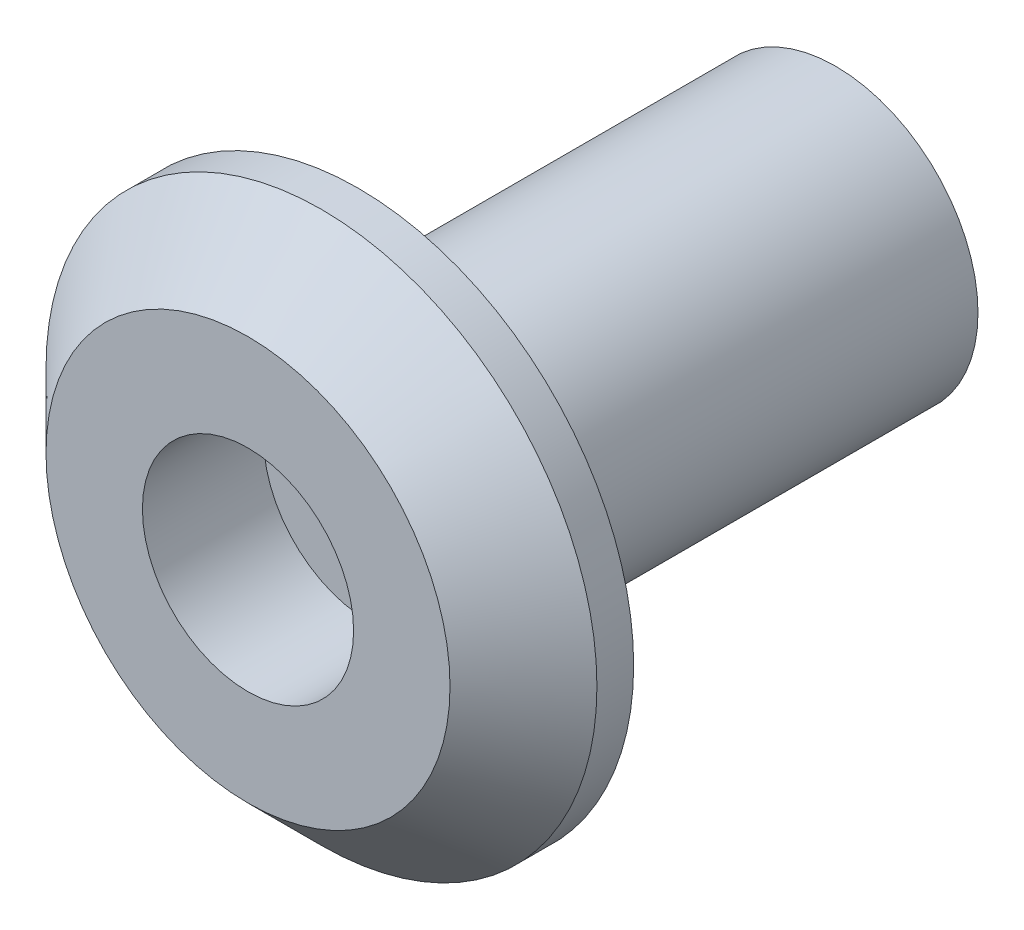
ISO-10303-21;
HEADER;
FILE_DESCRIPTION(('STEP AP214'),'2;1');
FILE_NAME('part.step','',(''),(''),'','','');
FILE_SCHEMA(('AUTOMOTIVE_DESIGN { 1 0 10303 214 1 1 1 1 }'));
ENDSEC;
DATA;
#1=APPLICATION_CONTEXT('core data for automotive mechanical design processes');
#2=APPLICATION_PROTOCOL_DEFINITION('international standard','automotive_design',2000,#1);
#3=PRODUCT_CONTEXT('',#1,'mechanical');
#4=PRODUCT('Part','Part','',(#3));
#5=PRODUCT_RELATED_PRODUCT_CATEGORY('part','',(#4));
#6=PRODUCT_DEFINITION_FORMATION('','',#4);
#7=PRODUCT_DEFINITION_CONTEXT('part definition',#1,'design');
#8=PRODUCT_DEFINITION('design','',#6,#7);
#9=PRODUCT_DEFINITION_SHAPE('','',#8);
#10=(LENGTH_UNIT() NAMED_UNIT(*) SI_UNIT(.MILLI.,.METRE.));
#11=(NAMED_UNIT(*) PLANE_ANGLE_UNIT() SI_UNIT($,.RADIAN.));
#12=(NAMED_UNIT(*) SI_UNIT($,.STERADIAN.) SOLID_ANGLE_UNIT());
#13=UNCERTAINTY_MEASURE_WITH_UNIT(LENGTH_MEASURE(1.E-05),#10,'distance_accuracy_value','');
#14=(GEOMETRIC_REPRESENTATION_CONTEXT(3) GLOBAL_UNCERTAINTY_ASSIGNED_CONTEXT((#13)) GLOBAL_UNIT_ASSIGNED_CONTEXT((#10,
#11,#12)) REPRESENTATION_CONTEXT('',''));
#15=CARTESIAN_POINT('',(0.,0.,0.));
#16=DIRECTION('',(0.,0.,1.));
#17=DIRECTION('',(1.,0.,0.));
#18=AXIS2_PLACEMENT_3D('',#15,#16,#17);
#19=CARTESIAN_POINT('',(0.,0.,1.5));
#20=DIRECTION('',(0.,0.,-1.));
#21=DIRECTION('',(-1.,0.,0.));
#22=AXIS2_PLACEMENT_3D('',#19,#20,#21);
#23=CYLINDRICAL_SURFACE('',#22,1.55);
#24=CARTESIAN_POINT('',(0.,0.,-14.5));
#25=DIRECTION('',(0.,0.,-1.));
#26=DIRECTION('',(-1.,0.,0.));
#27=AXIS2_PLACEMENT_3D('',#24,#25,#26);
#28=CIRCLE('',#27,1.55);
#29=CARTESIAN_POINT('',(-1.55,0.,-14.5));
#30=VERTEX_POINT('',#29);
#31=EDGE_CURVE('E60',#30,#30,#28,.T.);
#32=ORIENTED_EDGE('',*,*,#31,.T.);
#33=EDGE_LOOP('',(#32));
#34=FACE_BOUND('',#33,.T.);
#35=CARTESIAN_POINT('',(0.,0.,-1.8));
#36=DIRECTION('',(0.,0.,1.));
#37=DIRECTION('',(1.,0.,0.));
#38=AXIS2_PLACEMENT_3D('',#35,#36,#37);
#39=CIRCLE('',#38,1.55);
#40=CARTESIAN_POINT('',(1.55,0.,-1.8));
#41=VERTEX_POINT('',#40);
#42=EDGE_CURVE('E41',#41,#41,#39,.T.);
#43=ORIENTED_EDGE('',*,*,#42,.T.);
#44=EDGE_LOOP('',(#43));
#45=FACE_BOUND('',#44,.T.);
#46=ADVANCED_FACE('F36',(#34,#45),#23,.F.);
#47=CARTESIAN_POINT('',(0.,0.,-1.5));
#48=DIRECTION('',(0.,0.,1.));
#49=DIRECTION('',(1.,0.,0.));
#50=AXIS2_PLACEMENT_3D('',#47,#48,#49);
#51=PLANE('',#50);
#52=CARTESIAN_POINT('',(0.,0.,-1.5));
#53=DIRECTION('',(0.,0.,1.));
#54=DIRECTION('',(1.,0.,0.));
#55=AXIS2_PLACEMENT_3D('',#52,#53,#54);
#56=CIRCLE('',#55,7.5);
#57=CARTESIAN_POINT('',(7.5,0.,-1.5));
#58=VERTEX_POINT('',#57);
#59=EDGE_CURVE('E54',#58,#58,#56,.T.);
#60=ORIENTED_EDGE('',*,*,#59,.F.);
#61=EDGE_LOOP('',(#60));
#62=FACE_BOUND('',#61,.T.);
#63=CARTESIAN_POINT('',(0.,0.,-1.5));
#64=DIRECTION('',(0.,0.,1.));
#65=DIRECTION('',(1.,0.,0.));
#66=AXIS2_PLACEMENT_3D('',#63,#64,#65);
#67=CIRCLE('',#66,3.875);
#68=CARTESIAN_POINT('',(3.875,0.,-1.5));
#69=VERTEX_POINT('',#68);
#70=EDGE_CURVE('E10',#69,#69,#67,.F.);
#71=ORIENTED_EDGE('',*,*,#70,.F.);
#72=EDGE_LOOP('',(#71));
#73=FACE_BOUND('',#72,.T.);
#74=ADVANCED_FACE('F85',(#62,#73),#51,.F.);
#75=CARTESIAN_POINT('',(0.,0.,1.5));
#76=DIRECTION('',(0.,0.,1.));
#77=DIRECTION('',(1.,0.,0.));
#78=AXIS2_PLACEMENT_3D('',#75,#76,#77);
#79=PLANE('',#78);
#80=CARTESIAN_POINT('',(0.,0.,1.5));
#81=DIRECTION('',(0.,0.,1.));
#82=DIRECTION('',(1.,0.,0.));
#83=AXIS2_PLACEMENT_3D('',#80,#81,#82);
#84=CIRCLE('',#83,2.875);
#85=CARTESIAN_POINT('',(2.875,0.,1.5));
#86=VERTEX_POINT('',#85);
#87=EDGE_CURVE('E63',#86,#86,#84,.T.);
#88=ORIENTED_EDGE('',*,*,#87,.F.);
#89=EDGE_LOOP('',(#88));
#90=FACE_BOUND('',#89,.T.);
#91=CARTESIAN_POINT('',(0.,0.,1.5));
#92=DIRECTION('',(0.,0.,1.));
#93=DIRECTION('',(1.,0.,0.));
#94=AXIS2_PLACEMENT_3D('',#91,#92,#93);
#95=CIRCLE('',#94,5.5);
#96=CARTESIAN_POINT('',(5.5,0.,1.5));
#97=VERTEX_POINT('',#96);
#98=EDGE_CURVE('E49',#97,#97,#95,.T.);
#99=ORIENTED_EDGE('',*,*,#98,.T.);
#100=EDGE_LOOP('',(#99));
#101=FACE_BOUND('',#100,.T.);
#102=ADVANCED_FACE('F91',(#90,#101),#79,.T.);
#103=CARTESIAN_POINT('',(0.,0.,1.5));
#104=DIRECTION('',(0.,0.,-1.));
#105=DIRECTION('',(-1.,0.,0.));
#106=AXIS2_PLACEMENT_3D('',#103,#104,#105);
#107=CYLINDRICAL_SURFACE('',#106,7.5);
#108=CARTESIAN_POINT('',(0.,0.,-0.500000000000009));
#109=DIRECTION('',(0.,0.,1.));
#110=DIRECTION('',(1.,0.,0.));
#111=AXIS2_PLACEMENT_3D('',#108,#109,#110);
#112=CIRCLE('',#111,7.5);
#113=CARTESIAN_POINT('',(7.5,0.,-0.500000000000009));
#114=VERTEX_POINT('',#113);
#115=EDGE_CURVE('E45',#114,#114,#112,.F.);
#116=ORIENTED_EDGE('',*,*,#115,.T.);
#117=EDGE_LOOP('',(#116));
#118=FACE_BOUND('',#117,.T.);
#119=ORIENTED_EDGE('',*,*,#59,.T.);
#120=EDGE_LOOP('',(#119));
#121=FACE_BOUND('',#120,.T.);
#122=ADVANCED_FACE('F98',(#118,#121),#107,.T.);
#123=CARTESIAN_POINT('',(0.,0.,1.5));
#124=DIRECTION('',(0.,0.,-1.));
#125=DIRECTION('',(-1.,0.,0.));
#126=AXIS2_PLACEMENT_3D('',#123,#124,#125);
#127=CONICAL_SURFACE('',#126,5.5,0.785398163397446);
#128=ORIENTED_EDGE('',*,*,#115,.F.);
#129=EDGE_LOOP('',(#128));
#130=FACE_BOUND('',#129,.T.);
#131=ORIENTED_EDGE('',*,*,#98,.F.);
#132=EDGE_LOOP('',(#131));
#133=FACE_BOUND('',#132,.T.);
#134=ADVANCED_FACE('F39',(#130,#133),#127,.T.);
#135=CARTESIAN_POINT('',(0.,0.,-14.5));
#136=DIRECTION('',(0.,0.,-1.));
#137=DIRECTION('',(-1.,0.,0.));
#138=AXIS2_PLACEMENT_3D('',#135,#136,#137);
#139=PLANE('',#138);
#140=CARTESIAN_POINT('',(0.,0.,-14.5));
#141=DIRECTION('',(0.,0.,-1.));
#142=DIRECTION('',(-1.,0.,0.));
#143=AXIS2_PLACEMENT_3D('',#140,#141,#142);
#144=CIRCLE('',#143,3.875);
#145=CARTESIAN_POINT('',(3.875,0.,-14.5));
#146=VERTEX_POINT('',#145);
#147=EDGE_CURVE('E57',#146,#146,#144,.T.);
#148=ORIENTED_EDGE('',*,*,#147,.T.);
#149=EDGE_LOOP('',(#148));
#150=FACE_BOUND('',#149,.T.);
#151=ORIENTED_EDGE('',*,*,#31,.F.);
#152=EDGE_LOOP('',(#151));
#153=FACE_BOUND('',#152,.T.);
#154=ADVANCED_FACE('F105',(#150,#153),#139,.T.);
#155=CARTESIAN_POINT('',(0.,0.,-14.5));
#156=DIRECTION('',(0.,0.,1.));
#157=DIRECTION('',(1.,0.,0.));
#158=AXIS2_PLACEMENT_3D('',#155,#156,#157);
#159=CYLINDRICAL_SURFACE('',#158,3.875);
#160=CARTESIAN_POINT('',(3.875,0.,-14.5));
#161=CARTESIAN_POINT('',(3.875,0.,-14.3645833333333));
#162=CARTESIAN_POINT('',(3.875,0.,-14.2291666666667));
#163=CARTESIAN_POINT('',(3.875,0.,-13.9583333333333));
#164=CARTESIAN_POINT('',(3.875,0.,-13.8229166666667));
#165=CARTESIAN_POINT('',(3.875,0.,-13.5520833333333));
#166=CARTESIAN_POINT('',(3.875,0.,-13.4166666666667));
#167=CARTESIAN_POINT('',(3.875,0.,-13.1458333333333));
#168=CARTESIAN_POINT('',(3.875,0.,-13.0104166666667));
#169=CARTESIAN_POINT('',(3.875,0.,-12.7395833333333));
#170=CARTESIAN_POINT('',(3.875,0.,-12.6041666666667));
#171=CARTESIAN_POINT('',(3.875,0.,-12.3333333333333));
#172=CARTESIAN_POINT('',(3.875,0.,-12.1979166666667));
#173=CARTESIAN_POINT('',(3.875,0.,-11.9270833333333));
#174=CARTESIAN_POINT('',(3.875,0.,-11.7916666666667));
#175=CARTESIAN_POINT('',(3.875,0.,-11.5208333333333));
#176=CARTESIAN_POINT('',(3.875,0.,-11.3854166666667));
#177=CARTESIAN_POINT('',(3.875,0.,-11.1145833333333));
#178=CARTESIAN_POINT('',(3.875,0.,-10.9791666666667));
#179=CARTESIAN_POINT('',(3.875,0.,-10.7083333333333));
#180=CARTESIAN_POINT('',(3.875,0.,-10.5729166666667));
#181=CARTESIAN_POINT('',(3.875,0.,-10.3020833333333));
#182=CARTESIAN_POINT('',(3.875,0.,-10.1666666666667));
#183=CARTESIAN_POINT('',(3.875,0.,-9.89583333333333));
#184=CARTESIAN_POINT('',(3.875,0.,-9.76041666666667));
#185=CARTESIAN_POINT('',(3.875,0.,-9.48958333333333));
#186=CARTESIAN_POINT('',(3.875,0.,-9.35416666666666));
#187=CARTESIAN_POINT('',(3.875,0.,-9.08333333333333));
#188=CARTESIAN_POINT('',(3.875,0.,-8.94791666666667));
#189=CARTESIAN_POINT('',(3.875,0.,-8.67708333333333));
#190=CARTESIAN_POINT('',(3.875,0.,-8.54166666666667));
#191=CARTESIAN_POINT('',(3.875,0.,-8.27083333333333));
#192=CARTESIAN_POINT('',(3.875,0.,-8.13541666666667));
#193=CARTESIAN_POINT('',(3.875,0.,-7.86458333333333));
#194=CARTESIAN_POINT('',(3.875,0.,-7.72916666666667));
#195=CARTESIAN_POINT('',(3.875,0.,-7.45833333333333));
#196=CARTESIAN_POINT('',(3.875,0.,-7.32291666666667));
#197=CARTESIAN_POINT('',(3.875,0.,-7.05208333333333));
#198=CARTESIAN_POINT('',(3.875,0.,-6.91666666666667));
#199=CARTESIAN_POINT('',(3.875,0.,-6.64583333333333));
#200=CARTESIAN_POINT('',(3.875,0.,-6.51041666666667));
#201=CARTESIAN_POINT('',(3.875,0.,-6.23958333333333));
#202=CARTESIAN_POINT('',(3.875,0.,-6.10416666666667));
#203=CARTESIAN_POINT('',(3.875,0.,-5.83333333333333));
#204=CARTESIAN_POINT('',(3.875,0.,-5.69791666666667));
#205=CARTESIAN_POINT('',(3.875,0.,-5.42708333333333));
#206=CARTESIAN_POINT('',(3.875,0.,-5.29166666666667));
#207=CARTESIAN_POINT('',(3.875,0.,-5.02083333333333));
#208=CARTESIAN_POINT('',(3.875,0.,-4.88541666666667));
#209=CARTESIAN_POINT('',(3.875,0.,-4.61458333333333));
#210=CARTESIAN_POINT('',(3.875,0.,-4.47916666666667));
#211=CARTESIAN_POINT('',(3.875,0.,-4.20833333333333));
#212=CARTESIAN_POINT('',(3.875,0.,-4.07291666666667));
#213=CARTESIAN_POINT('',(3.875,0.,-3.80208333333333));
#214=CARTESIAN_POINT('',(3.875,0.,-3.66666666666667));
#215=CARTESIAN_POINT('',(3.875,0.,-3.39583333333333));
#216=CARTESIAN_POINT('',(3.875,0.,-3.26041666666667));
#217=CARTESIAN_POINT('',(3.875,0.,-2.98958333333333));
#218=CARTESIAN_POINT('',(3.875,0.,-2.85416666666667));
#219=CARTESIAN_POINT('',(3.875,0.,-2.58333333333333));
#220=CARTESIAN_POINT('',(3.875,0.,-2.44791666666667));
#221=CARTESIAN_POINT('',(3.875,0.,-2.17708333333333));
#222=CARTESIAN_POINT('',(3.875,0.,-2.04166666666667));
#223=CARTESIAN_POINT('',(3.875,0.,-1.77083333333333));
#224=CARTESIAN_POINT('',(3.875,0.,-1.63541666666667));
#225=CARTESIAN_POINT('',(3.875,0.,-1.5));
#226=B_SPLINE_CURVE_WITH_KNOTS('',3,(#160,#161,#162,#163,#164,#165,#166,#167,#168,#169,#170,
#171,#172,#173,#174,#175,#176,#177,#178,#179,#180,#181,#182,#183,#184,#185,#186,#187,#188,#189,
#190,#191,#192,#193,#194,#195,#196,#197,#198,#199,#200,#201,#202,#203,#204,#205,#206,#207,#208,
#209,#210,#211,#212,#213,#214,#215,#216,#217,#218,#219,#220,#221,#222,#223,#224,#225),
.UNSPECIFIED.,.F.,.F.,(4,2,2,2,2,2,2,2,2,2,2,2,2,2,2,2,2,2,2,2,2,2,2,2,2,2,2,2,2,2,2,2,4),(0.,
0.406249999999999,0.812499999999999,1.21875,1.625,2.03125,2.4375,2.84375,3.25,3.65625,4.0625,
4.46875,4.875,5.28125,5.6875,6.09375,6.5,6.90625,7.3125,7.71875,8.125,8.53125,8.9375,9.34375,
9.75,10.15625,10.5625,10.96875,11.375,11.78125,12.1875,12.59375,13.),.UNSPECIFIED.);
#227=EDGE_CURVE('BSEAM81',#146,#69,#226,.T.);
#228=ORIENTED_EDGE('',*,*,#147,.F.);
#229=ORIENTED_EDGE('',*,*,#70,.T.);
#230=ORIENTED_EDGE('',*,*,#227,.T.);
#231=ORIENTED_EDGE('',*,*,#227,.F.);
#232=EDGE_LOOP('',(#228,#230,#229,#231));
#233=FACE_BOUND('',#232,.T.);
#234=ADVANCED_FACE('F81',(#233),#159,.T.);
#235=CARTESIAN_POINT('',(0.,0.,-1.8));
#236=DIRECTION('',(0.,0.,1.));
#237=DIRECTION('',(1.,0.,0.));
#238=AXIS2_PLACEMENT_3D('',#235,#236,#237);
#239=CYLINDRICAL_SURFACE('',#238,2.875);
#240=CARTESIAN_POINT('',(0.,0.,-1.8));
#241=DIRECTION('',(0.,0.,1.));
#242=DIRECTION('',(1.,0.,0.));
#243=AXIS2_PLACEMENT_3D('',#240,#241,#242);
#244=CIRCLE('',#243,2.875);
#245=CARTESIAN_POINT('',(2.875,0.,-1.8));
#246=VERTEX_POINT('',#245);
#247=EDGE_CURVE('E66',#246,#246,#244,.T.);
#248=ORIENTED_EDGE('',*,*,#247,.F.);
#249=EDGE_LOOP('',(#248));
#250=FACE_BOUND('',#249,.T.);
#251=ORIENTED_EDGE('',*,*,#87,.T.);
#252=EDGE_LOOP('',(#251));
#253=FACE_BOUND('',#252,.T.);
#254=ADVANCED_FACE('F76',(#250,#253),#239,.F.);
#255=CARTESIAN_POINT('',(0.,0.,-1.8));
#256=DIRECTION('',(0.,0.,1.));
#257=DIRECTION('',(1.,0.,0.));
#258=AXIS2_PLACEMENT_3D('',#255,#256,#257);
#259=PLANE('',#258);
#260=ORIENTED_EDGE('',*,*,#42,.F.);
#261=EDGE_LOOP('',(#260));
#262=FACE_BOUND('',#261,.T.);
#263=ORIENTED_EDGE('',*,*,#247,.T.);
#264=EDGE_LOOP('',(#263));
#265=FACE_BOUND('',#264,.T.);
#266=ADVANCED_FACE('F74',(#262,#265),#259,.T.);
#267=CLOSED_SHELL('',(#46,#74,#102,#122,#134,#154,#234,#254,#266));
#268=MANIFOLD_SOLID_BREP('B2',#267);
#269=ADVANCED_BREP_SHAPE_REPRESENTATION('',(#18,#268),#14);
#270=SHAPE_DEFINITION_REPRESENTATION(#9,#269);
ENDSEC;
END-ISO-10303-21;
